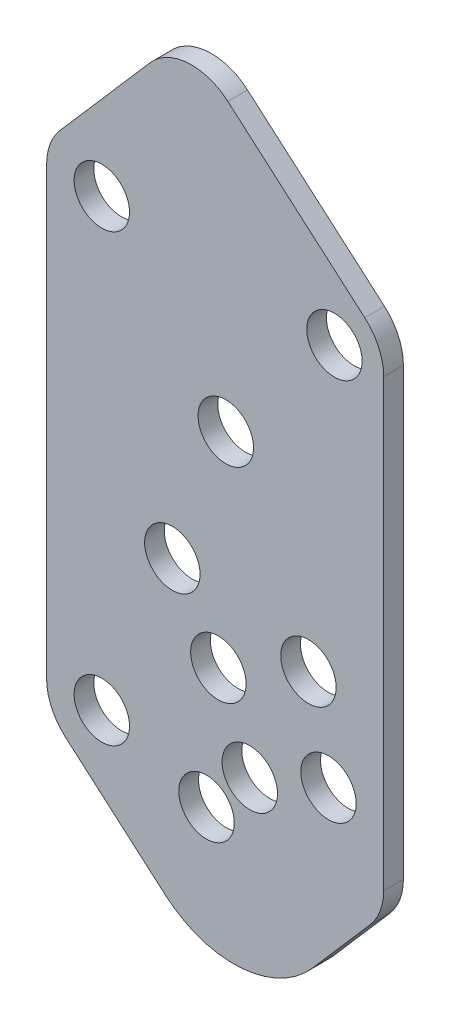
from build123d import *

# Parameters (mm, degrees)
BOSS_EXTRUDE1_DEPTH = 2.54
HOLE1_D             = 7.14375
HOLE11_D            = 7.14375
HOLE12_D            = 7.1374


with BuildPart() as part:
    # Sketch2 → Boss-Extrude1 (new body)
    with BuildSketch(Plane.XY.offset(-29.21)):
        with BuildLine():
            Line((-781.974731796, 17.566297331), (-799.607614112, 32.879205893))
            ThreePointArc((-799.607614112, 32.879205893), (-804.770457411, 34.603864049), (-809.640656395, 32.172700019))
            Line((-809.640656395, 32.172700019), (-821.217774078, 18.841597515))
            ThreePointArc((-821.217774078, 18.841597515), (-822.510220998, 16.667376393), (-822.96, 14.178329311))
            Line((-822.96, 14.178329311), (-822.96, -43.175164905))
            ThreePointArc((-822.96, -43.175164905), (-822.318923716, -46.12604448), (-820.511268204, -48.544938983))
            Line((-820.511268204, -48.544938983), (-807.672827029, -59.69421522))
            ThreePointArc((-807.672827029, -59.69421522), (-797.900302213, -62.958746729), (-788.681711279, -58.35690053))
            Line((-788.681711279, -58.35690053), (-781.268225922, -49.820239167))
            ThreePointArc((-781.268225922, -49.820239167), (-779.975779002, -47.646018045), (-779.526, -45.156970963))
            Line((-779.526, -45.156970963), (-779.526, 12.196523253))
            ThreePointArc((-779.526, 12.196523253), (-780.167076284, 15.147402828), (-781.974731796, 17.566297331))
        make_face()
    extrude(amount=-BOSS_EXTRUDE1_DEPTH)

    # Hole1 (through all)
    with Locations(Plane(origin=(-803.527406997, 6.49142751, -29.21), x_dir=(1, 0, 0), z_dir=(0, 0, 1))):
        with Locations((3.654260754, -10.601140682), (-3.2329819, -28.177490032), (14.306628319, -32.044640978), (6.749406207, -47.668414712), (1.172624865, -53.732682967)):
            Hole(HOLE1_D / 2)

    # Hole11 (through all)
    with Locations(Plane(origin=(-804.484056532, -20.349265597, -29.21), x_dir=(1, 0, 0), z_dir=(0, 0, 1))):
        with Locations((3.654260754, -10.601140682)):
            Hole(HOLE11_D / 2)

    # Hole12 (through all)
    with Locations(Plane(origin=(-819.502260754, 24.779469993, -29.21), x_dir=(1, 0, 0), z_dir=(0, 0, 1))):
        with Locations((3.654260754, -10.601140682), (33.626260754, -12.235458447), (32.864260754, -61.998940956), (3.654260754, -67.954634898)):
            Hole(HOLE12_D / 2)


solid = part.part
